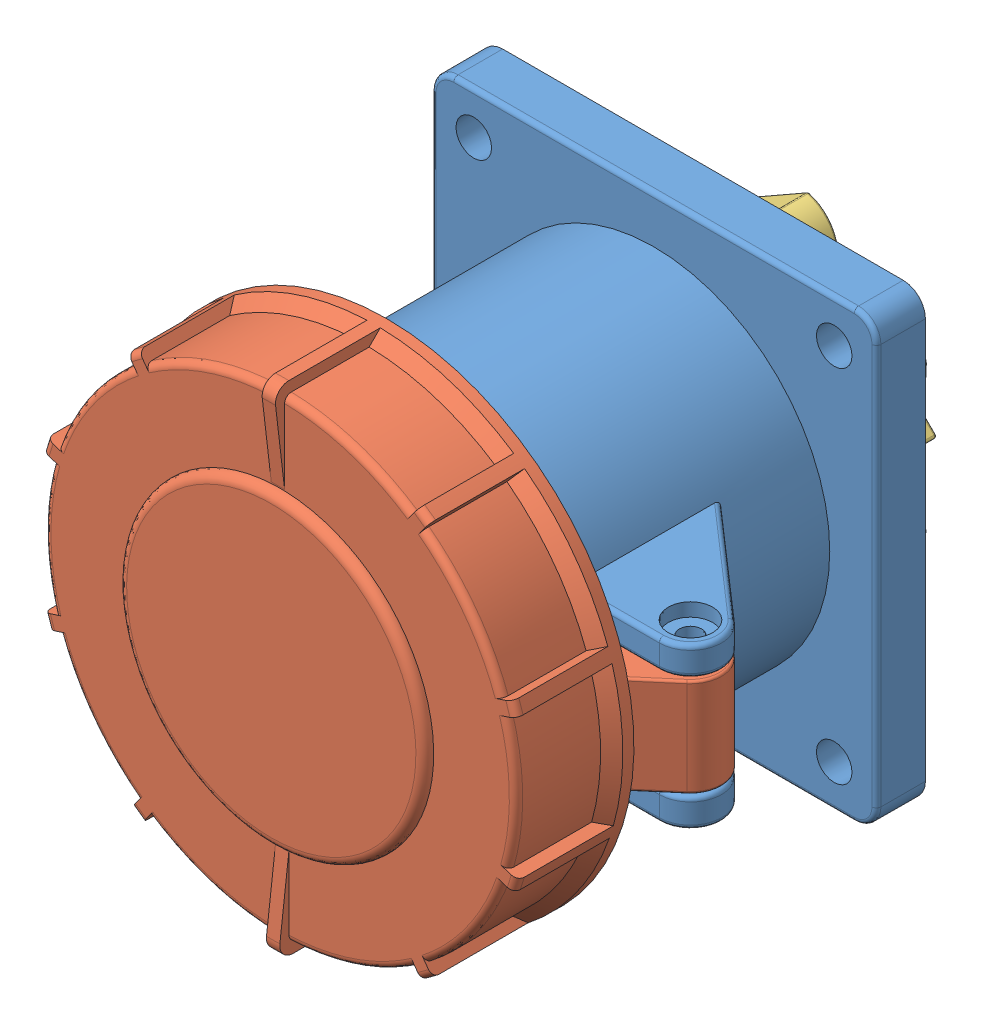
SolidWorks assembly Сборка 3352.SLDASM, configuration По умолчанию (file format 10000). Lengths in mm.
Overall size (117.7 111.32 132.3).
3 component instances, 3 part files, 5 mates.
Components (placement in the parent):
- Корпус 3352,3342-1: Корпус 3352,3342.SLDPRT [По умолчанию] at (71.3157 40.0582 20.8283) size (112.2 100 82)
- Крышка 3342, 4342, 3352, 4352-1: Крышка 3342, 4342, 3352, 4352.SLDPRT [По умолчанию] at (71.3157 40.0582 115.8283) x (0 1 0) z (0 0 -1) size (111.32 117.7 46.24)
- Колодка 3352,4352-1: Колодка 3352,4352.SLDPRT [По умолчанию] at (71.3157 39.7327 20.8283) x (0.640266 0.768153 0) z (0 0 -1) size (72 72 112.06)
Mates (geometry in assembly coordinates):
- Концентричный1: concentric anti-aligned: cylinder of Корпус 3352,3342-1 through (71.3157 40.0582 -4.1717) axis (0 0 1) radius 36.5; cylinder of Крышка 3342, 4342, 3352, 4352-1 through (71.3157 40.0582 102.8283) axis (0 0 -1) radius 50.5
- Параллельность1: parallel aligned: plane of Корпус 3352,3342-1 through (121.3157 90.0582 31.8283) normal (0 1 0); plane of Крышка 3342, 4342, 3352, 4352-1 through (126.5155 51.0582 78.8283) normal (0 1 0)
- Совпадение1: coincident anti-aligned: plane of Корпус 3352,3342-1 through (71.3157 40.0582 102.8283) normal (0 0 1); plane of Крышка 3342, 4342, 3352, 4352-1 through (71.3157 40.0582 102.8283) normal (0 0 -1)
- Концентричный2: concentric aligned: cylinder of Корпус 3352,3342-1 through (71.3157 39.7327 23.8283) axis (0 0 -1) radius 31; cylinder of Колодка 3352,4352-1 through (71.3157 39.7327 97.8283) axis (0 0 -1) radius 30
- Совпадение2: coincident anti-aligned: plane of Корпус 3352,3342-1 through (71.3157 40.0582 20.8283) normal (0 0 -1); plane of Колодка 3352,4352-1 through (71.3157 39.7327 20.8283) normal (0 0 1)
